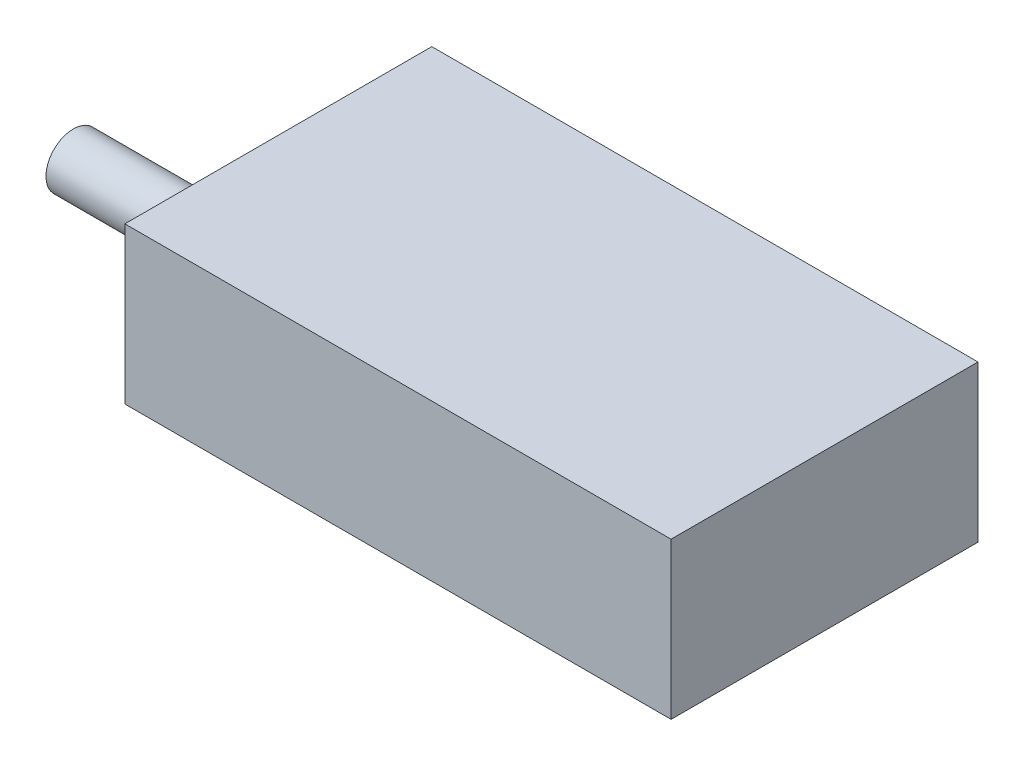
from build123d import *

# Parameters (mm, degrees)
SKETCH_1_W      = 105
SKETCH_1_H      = 59
EXTRUDE_1_DEPTH = 30
SKETCH_2_R      = 5.25
EXTRUDE_2_DEPTH = 34.5


with BuildPart() as part:
    # Sketch 1 → Extrude 1 (new body)
    with BuildSketch(Plane(origin=(0, 0, 0), x_dir=(1, 0, 0), z_dir=(0, 1, 0))):
        with Locations((25.667898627, -12.979408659)):
            Rectangle(SKETCH_1_W, SKETCH_1_H)
    extrude(amount=EXTRUDE_1_DEPTH)

    # Sketch 2 → Extrude 2 (add)
    with BuildSketch(Plane.ZY.offset(26.832101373)):
        with Locations(Location((17.89030339, 11, 0), (0, 0, 180))):
            Circle(SKETCH_2_R)
    extrude(amount=EXTRUDE_2_DEPTH)


solid = part.part
